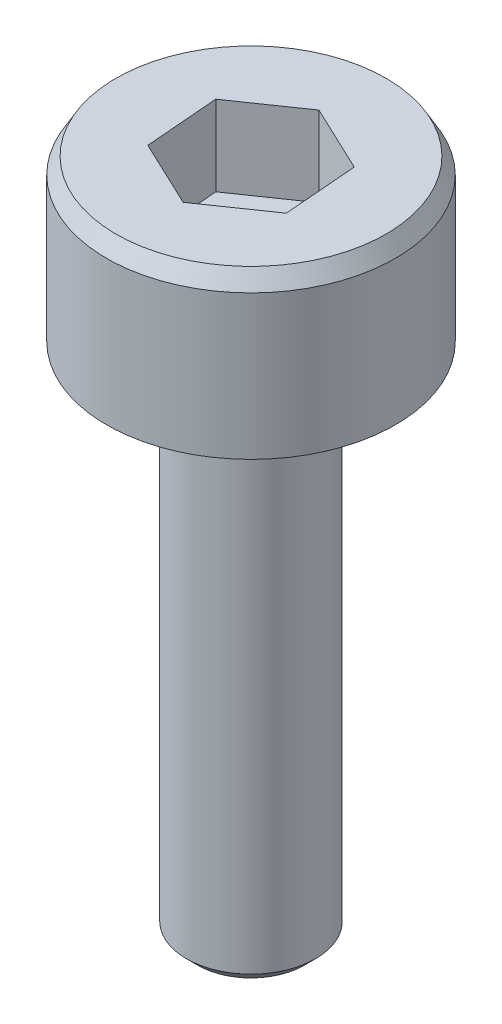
ISO-10303-21;
HEADER;
FILE_DESCRIPTION(('STEP AP214'),'2;1');
FILE_NAME('part.step','',(''),(''),'','','');
FILE_SCHEMA(('AUTOMOTIVE_DESIGN { 1 0 10303 214 1 1 1 1 }'));
ENDSEC;
DATA;
#1=APPLICATION_CONTEXT('core data for automotive mechanical design processes');
#2=APPLICATION_PROTOCOL_DEFINITION('international standard','automotive_design',2000,#1);
#3=PRODUCT_CONTEXT('',#1,'mechanical');
#4=PRODUCT('Part','Part','',(#3));
#5=PRODUCT_RELATED_PRODUCT_CATEGORY('part','',(#4));
#6=PRODUCT_DEFINITION_FORMATION('','',#4);
#7=PRODUCT_DEFINITION_CONTEXT('part definition',#1,'design');
#8=PRODUCT_DEFINITION('design','',#6,#7);
#9=PRODUCT_DEFINITION_SHAPE('','',#8);
#10=(LENGTH_UNIT() NAMED_UNIT(*) SI_UNIT(.MILLI.,.METRE.));
#11=(NAMED_UNIT(*) PLANE_ANGLE_UNIT() SI_UNIT($,.RADIAN.));
#12=(NAMED_UNIT(*) SI_UNIT($,.STERADIAN.) SOLID_ANGLE_UNIT());
#13=UNCERTAINTY_MEASURE_WITH_UNIT(LENGTH_MEASURE(1.E-05),#10,'distance_accuracy_value','');
#14=(GEOMETRIC_REPRESENTATION_CONTEXT(3) GLOBAL_UNCERTAINTY_ASSIGNED_CONTEXT((#13)) GLOBAL_UNIT_ASSIGNED_CONTEXT((#10,
#11,#12)) REPRESENTATION_CONTEXT('',''));
#15=CARTESIAN_POINT('',(0.,0.,0.));
#16=DIRECTION('',(0.,0.,1.));
#17=DIRECTION('',(1.,0.,0.));
#18=AXIS2_PLACEMENT_3D('',#15,#16,#17);
#19=CARTESIAN_POINT('',(-0.279369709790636,8.74059404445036,-3.05433407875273));
#20=DIRECTION('',(0.,-1.,0.));
#21=DIRECTION('',(0.568386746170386,0.,0.82276151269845));
#22=AXIS2_PLACEMENT_3D('',#19,#20,#21);
#23=PLANE('',#22);
#24=DIRECTION('',(-0.904002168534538,0.,-0.427527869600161));
#25=VECTOR('',#24,1.);
#26=CARTESIAN_POINT('',(-0.279369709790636,8.74059404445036,-3.05433407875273));
#27=LINE('',#26,#25);
#28=CARTESIAN_POINT('',(-0.279369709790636,8.74059404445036,-3.05433407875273));
#29=VERTEX_POINT('',#28);
#30=CARTESIAN_POINT('',(-1.32349221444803,8.74059404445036,-3.54812876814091));
#31=VERTEX_POINT('',#30);
#32=EDGE_CURVE('E189',#29,#31,#27,.T.);
#33=ORIENTED_EDGE('',*,*,#32,.T.);
#34=DIRECTION('',(-0.82276151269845,0.,0.568386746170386));
#35=VECTOR('',#34,1.);
#36=CARTESIAN_POINT('',(-1.32349221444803,8.74059404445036,-3.54812876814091));
#37=LINE('',#36,#35);
#38=CARTESIAN_POINT('',(-2.27378176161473,8.74059404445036,-2.89164207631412));
#39=VERTEX_POINT('',#38);
#40=EDGE_CURVE('E11',#31,#39,#37,.T.);
#41=ORIENTED_EDGE('',*,*,#40,.T.);
#42=DIRECTION('',(0.0808566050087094,0.,0.996725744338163));
#43=VECTOR('',#42,1.);
#44=CARTESIAN_POINT('',(-2.27378176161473,8.74059404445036,-2.89164207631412));
#45=LINE('',#44,#43);
#46=CARTESIAN_POINT('',(-2.18039238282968,8.74059404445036,-1.74042384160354));
#47=VERTEX_POINT('',#46);
#48=EDGE_CURVE('E134',#39,#47,#45,.T.);
#49=ORIENTED_EDGE('',*,*,#48,.T.);
#50=DIRECTION('',(0.904002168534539,0.,0.42752786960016));
#51=VECTOR('',#50,1.);
#52=CARTESIAN_POINT('',(-2.18039238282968,8.74059404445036,-1.74042384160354));
#53=LINE('',#52,#51);
#54=CARTESIAN_POINT('',(-1.13626987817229,8.74059404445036,-1.24662915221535));
#55=VERTEX_POINT('',#54);
#56=EDGE_CURVE('E180',#47,#55,#53,.T.);
#57=ORIENTED_EDGE('',*,*,#56,.T.);
#58=DIRECTION('',(0.82276151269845,0.,-0.568386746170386));
#59=VECTOR('',#58,1.);
#60=CARTESIAN_POINT('',(-1.13626987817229,8.74059404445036,-1.24662915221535));
#61=LINE('',#60,#59);
#62=CARTESIAN_POINT('',(-0.185980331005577,8.74059404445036,-1.90311584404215));
#63=VERTEX_POINT('',#62);
#64=EDGE_CURVE('E178',#55,#63,#61,.T.);
#65=ORIENTED_EDGE('',*,*,#64,.T.);
#66=DIRECTION('',(-0.0808566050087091,0.,-0.996725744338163));
#67=VECTOR('',#66,1.);
#68=CARTESIAN_POINT('',(-0.185980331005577,8.74059404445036,-1.90311584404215));
#69=LINE('',#68,#67);
#70=EDGE_CURVE('E143',#63,#29,#69,.T.);
#71=ORIENTED_EDGE('',*,*,#70,.T.);
#72=EDGE_LOOP('',(#33,#41,#49,#57,#65,#71));
#73=FACE_BOUND('',#72,.T.);
#74=ADVANCED_FACE('F16',(#73),#23,.F.);
#75=CARTESIAN_POINT('',(-1.32349221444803,8.74059404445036,-3.54812876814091));
#76=DIRECTION('',(-0.568386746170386,0.,-0.82276151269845));
#77=DIRECTION('',(0.82276151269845,0.,-0.568386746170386));
#78=AXIS2_PLACEMENT_3D('',#75,#76,#77);
#79=PLANE('',#78);
#80=DIRECTION('',(-0.82276151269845,0.,0.568386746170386));
#81=VECTOR('',#80,1.);
#82=CARTESIAN_POINT('',(-1.32349221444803,9.99059404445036,-3.54812876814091));
#83=LINE('',#82,#81);
#84=CARTESIAN_POINT('',(-1.32349221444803,9.99059404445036,-3.54812876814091));
#85=VERTEX_POINT('',#84);
#86=CARTESIAN_POINT('',(-2.27378176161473,9.99059404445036,-2.89164207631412));
#87=VERTEX_POINT('',#86);
#88=EDGE_CURVE('E20',#85,#87,#83,.T.);
#89=ORIENTED_EDGE('',*,*,#88,.T.);
#90=DIRECTION('',(0.,1.,0.));
#91=VECTOR('',#90,1.);
#92=CARTESIAN_POINT('',(-2.27378176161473,8.74059404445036,-2.89164207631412));
#93=LINE('',#92,#91);
#94=EDGE_CURVE('E27',#39,#87,#93,.T.);
#95=ORIENTED_EDGE('',*,*,#94,.F.);
#96=ORIENTED_EDGE('',*,*,#40,.F.);
#97=DIRECTION('',(0.,1.,0.));
#98=VECTOR('',#97,1.);
#99=CARTESIAN_POINT('',(-1.32349221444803,8.74059404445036,-3.54812876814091));
#100=LINE('',#99,#98);
#101=EDGE_CURVE('E164',#31,#85,#100,.T.);
#102=ORIENTED_EDGE('',*,*,#101,.T.);
#103=EDGE_LOOP('',(#89,#95,#96,#102));
#104=FACE_BOUND('',#103,.T.);
#105=ADVANCED_FACE('F162',(#104),#79,.F.);
#106=CARTESIAN_POINT('',(-2.27378176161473,8.74059404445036,-2.89164207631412));
#107=DIRECTION('',(-0.996725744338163,0.,0.0808566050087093));
#108=DIRECTION('',(0.,1.,0.));
#109=AXIS2_PLACEMENT_3D('',#106,#107,#108);
#110=PLANE('',#109);
#111=DIRECTION('',(0.0808566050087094,0.,0.996725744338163));
#112=VECTOR('',#111,1.);
#113=CARTESIAN_POINT('',(-2.27378176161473,9.99059404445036,-2.89164207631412));
#114=LINE('',#113,#112);
#115=CARTESIAN_POINT('',(-2.18039238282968,9.99059404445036,-1.74042384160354));
#116=VERTEX_POINT('',#115);
#117=EDGE_CURVE('E141',#87,#116,#114,.T.);
#118=ORIENTED_EDGE('',*,*,#117,.T.);
#119=DIRECTION('',(0.,1.,0.));
#120=VECTOR('',#119,1.);
#121=CARTESIAN_POINT('',(-2.18039238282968,8.74059404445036,-1.74042384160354));
#122=LINE('',#121,#120);
#123=EDGE_CURVE('E136',#47,#116,#122,.T.);
#124=ORIENTED_EDGE('',*,*,#123,.F.);
#125=ORIENTED_EDGE('',*,*,#48,.F.);
#126=ORIENTED_EDGE('',*,*,#94,.T.);
#127=EDGE_LOOP('',(#118,#124,#125,#126));
#128=FACE_BOUND('',#127,.T.);
#129=ADVANCED_FACE('F156',(#128),#110,.F.);
#130=CARTESIAN_POINT('',(-2.18039238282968,8.74059404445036,-1.74042384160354));
#131=DIRECTION('',(-0.42752786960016,0.,0.904002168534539));
#132=DIRECTION('',(-0.904002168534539,0.,-0.42752786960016));
#133=AXIS2_PLACEMENT_3D('',#130,#131,#132);
#134=PLANE('',#133);
#135=DIRECTION('',(0.904002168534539,0.,0.42752786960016));
#136=VECTOR('',#135,1.);
#137=CARTESIAN_POINT('',(-2.18039238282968,9.99059404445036,-1.74042384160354));
#138=LINE('',#137,#136);
#139=CARTESIAN_POINT('',(-1.13626987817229,9.99059404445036,-1.24662915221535));
#140=VERTEX_POINT('',#139);
#141=EDGE_CURVE('E137',#116,#140,#138,.T.);
#142=ORIENTED_EDGE('',*,*,#141,.T.);
#143=DIRECTION('',(0.,1.,0.));
#144=VECTOR('',#143,1.);
#145=CARTESIAN_POINT('',(-1.13626987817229,8.74059404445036,-1.24662915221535));
#146=LINE('',#145,#144);
#147=EDGE_CURVE('E194',#55,#140,#146,.T.);
#148=ORIENTED_EDGE('',*,*,#147,.F.);
#149=ORIENTED_EDGE('',*,*,#56,.F.);
#150=ORIENTED_EDGE('',*,*,#123,.T.);
#151=EDGE_LOOP('',(#142,#148,#149,#150));
#152=FACE_BOUND('',#151,.T.);
#153=ADVANCED_FACE('F318',(#152),#134,.F.);
#154=CARTESIAN_POINT('',(-1.13626987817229,8.74059404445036,-1.24662915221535));
#155=DIRECTION('',(0.568386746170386,0.,0.82276151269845));
#156=DIRECTION('',(0.,-1.,0.));
#157=AXIS2_PLACEMENT_3D('',#154,#155,#156);
#158=PLANE('',#157);
#159=DIRECTION('',(0.82276151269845,0.,-0.568386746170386));
#160=VECTOR('',#159,1.);
#161=CARTESIAN_POINT('',(-1.13626987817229,9.99059404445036,-1.24662915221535));
#162=LINE('',#161,#160);
#163=CARTESIAN_POINT('',(-0.185980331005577,9.99059404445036,-1.90311584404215));
#164=VERTEX_POINT('',#163);
#165=EDGE_CURVE('E142',#140,#164,#162,.T.);
#166=ORIENTED_EDGE('',*,*,#165,.T.);
#167=DIRECTION('',(0.,1.,0.));
#168=VECTOR('',#167,1.);
#169=CARTESIAN_POINT('',(-0.185980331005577,8.74059404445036,-1.90311584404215));
#170=LINE('',#169,#168);
#171=EDGE_CURVE('E146',#63,#164,#170,.T.);
#172=ORIENTED_EDGE('',*,*,#171,.F.);
#173=ORIENTED_EDGE('',*,*,#64,.F.);
#174=ORIENTED_EDGE('',*,*,#147,.T.);
#175=EDGE_LOOP('',(#166,#172,#173,#174));
#176=FACE_BOUND('',#175,.T.);
#177=ADVANCED_FACE('F314',(#176),#158,.F.);
#178=CARTESIAN_POINT('',(-0.185980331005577,8.74059404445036,-1.90311584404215));
#179=DIRECTION('',(0.996725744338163,0.,-0.0808566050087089));
#180=DIRECTION('',(0.,-1.,0.));
#181=AXIS2_PLACEMENT_3D('',#178,#179,#180);
#182=PLANE('',#181);
#183=DIRECTION('',(-0.0808566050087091,0.,-0.996725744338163));
#184=VECTOR('',#183,1.);
#185=CARTESIAN_POINT('',(-0.185980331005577,9.99059404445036,-1.90311584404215));
#186=LINE('',#185,#184);
#187=CARTESIAN_POINT('',(-0.279369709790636,9.99059404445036,-3.05433407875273));
#188=VERTEX_POINT('',#187);
#189=EDGE_CURVE('E128',#164,#188,#186,.T.);
#190=ORIENTED_EDGE('',*,*,#189,.T.);
#191=DIRECTION('',(0.,1.,0.));
#192=VECTOR('',#191,1.);
#193=CARTESIAN_POINT('',(-0.279369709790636,8.74059404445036,-3.05433407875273));
#194=LINE('',#193,#192);
#195=EDGE_CURVE('E147',#29,#188,#194,.T.);
#196=ORIENTED_EDGE('',*,*,#195,.F.);
#197=ORIENTED_EDGE('',*,*,#70,.F.);
#198=ORIENTED_EDGE('',*,*,#171,.T.);
#199=EDGE_LOOP('',(#190,#196,#197,#198));
#200=FACE_BOUND('',#199,.T.);
#201=ADVANCED_FACE('F308',(#200),#182,.F.);
#202=CARTESIAN_POINT('',(-0.279369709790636,8.74059404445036,-3.05433407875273));
#203=DIRECTION('',(0.427527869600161,0.,-0.904002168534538));
#204=DIRECTION('',(0.,-1.,0.));
#205=AXIS2_PLACEMENT_3D('',#202,#203,#204);
#206=PLANE('',#205);
#207=DIRECTION('',(-0.904002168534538,0.,-0.427527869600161));
#208=VECTOR('',#207,1.);
#209=CARTESIAN_POINT('',(-0.279369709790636,9.99059404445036,-3.05433407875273));
#210=LINE('',#209,#208);
#211=EDGE_CURVE('E119',#188,#85,#210,.T.);
#212=ORIENTED_EDGE('',*,*,#211,.T.);
#213=ORIENTED_EDGE('',*,*,#101,.F.);
#214=ORIENTED_EDGE('',*,*,#32,.F.);
#215=ORIENTED_EDGE('',*,*,#195,.T.);
#216=EDGE_LOOP('',(#212,#213,#214,#215));
#217=FACE_BOUND('',#216,.T.);
#218=ADVANCED_FACE('F304',(#217),#206,.F.);
#219=CARTESIAN_POINT('',(-1.230250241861,7.49059404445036,-2.39712390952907));
#220=DIRECTION('',(0.,1.,0.));
#221=DIRECTION('',(0.82276151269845,0.,-0.568386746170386));
#222=AXIS2_PLACEMENT_3D('',#219,#220,#221);
#223=PLANE('',#222);
#224=CARTESIAN_POINT('',(-1.230250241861,7.49059404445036,-2.39712390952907));
#225=DIRECTION('',(0.,1.,0.));
#226=DIRECTION('',(0.82276151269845,0.,-0.568386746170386));
#227=AXIS2_PLACEMENT_3D('',#224,#225,#226);
#228=CIRCLE('',#227,1.0055);
#229=CARTESIAN_POINT('',(-0.402963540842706,7.49059404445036,-2.96863678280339));
#230=VERTEX_POINT('',#229);
#231=EDGE_CURVE('E114',#230,#230,#228,.T.);
#232=ORIENTED_EDGE('',*,*,#231,.T.);
#233=EDGE_LOOP('',(#232));
#234=FACE_BOUND('',#233,.T.);
#235=CARTESIAN_POINT('',(-1.230250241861,7.49059404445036,-2.39712390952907));
#236=DIRECTION('',(0.,1.,0.));
#237=DIRECTION('',(0.82276151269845,0.,-0.568386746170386));
#238=AXIS2_PLACEMENT_3D('',#235,#236,#237);
#239=CIRCLE('',#238,2.25);
#240=CARTESIAN_POINT('',(-3.08146364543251,7.49059404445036,-1.1182537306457));
#241=VERTEX_POINT('',#240);
#242=EDGE_CURVE('E120',#241,#241,#239,.T.);
#243=ORIENTED_EDGE('',*,*,#242,.F.);
#244=EDGE_LOOP('',(#243));
#245=FACE_BOUND('',#244,.T.);
#246=ADVANCED_FACE('F115',(#234,#245),#223,.F.);
#247=CARTESIAN_POINT('',(-1.230250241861,9.99059404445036,-2.39712390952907));
#248=DIRECTION('',(0.,1.,0.));
#249=DIRECTION('',(0.82276151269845,0.,-0.568386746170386));
#250=AXIS2_PLACEMENT_3D('',#247,#248,#249);
#251=PLANE('',#250);
#252=ORIENTED_EDGE('',*,*,#211,.F.);
#253=ORIENTED_EDGE('',*,*,#189,.F.);
#254=ORIENTED_EDGE('',*,*,#165,.F.);
#255=ORIENTED_EDGE('',*,*,#141,.F.);
#256=ORIENTED_EDGE('',*,*,#117,.F.);
#257=ORIENTED_EDGE('',*,*,#88,.F.);
#258=EDGE_LOOP('',(#252,#253,#254,#255,#256,#257));
#259=FACE_BOUND('',#258,.T.);
#260=CARTESIAN_POINT('',(-1.230250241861,9.99059404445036,-2.39712390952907));
#261=DIRECTION('',(0.,1.,0.));
#262=DIRECTION('',(0.82276151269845,0.,-0.568386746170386));
#263=AXIS2_PLACEMENT_3D('',#260,#261,#262);
#264=CIRCLE('',#263,2.10335303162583);
#265=CARTESIAN_POINT('',(-2.96080816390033,9.99059404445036,-1.20160592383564));
#266=VERTEX_POINT('',#265);
#267=EDGE_CURVE('E184',#266,#266,#264,.T.);
#268=ORIENTED_EDGE('',*,*,#267,.T.);
#269=EDGE_LOOP('',(#268));
#270=FACE_BOUND('',#269,.T.);
#271=ADVANCED_FACE('F167',(#259,#270),#251,.T.);
#272=CARTESIAN_POINT('',(-1.230250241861,-0.509405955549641,-2.39712390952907));
#273=DIRECTION('',(0.,1.,0.));
#274=DIRECTION('',(0.82276151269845,0.,-0.568386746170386));
#275=AXIS2_PLACEMENT_3D('',#272,#273,#274);
#276=PLANE('',#275);
#277=CARTESIAN_POINT('',(-1.230250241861,-0.509405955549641,-2.39712390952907));
#278=DIRECTION('',(0.,-1.,0.));
#279=DIRECTION('',(0.82276151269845,0.,-0.568386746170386));
#280=AXIS2_PLACEMENT_3D('',#277,#278,#279);
#281=CIRCLE('',#280,0.8305);
#282=CARTESIAN_POINT('',(-0.546946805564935,-0.509405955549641,-2.86916910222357));
#283=VERTEX_POINT('',#282);
#284=EDGE_CURVE('E81',#283,#283,#281,.T.);
#285=ORIENTED_EDGE('',*,*,#284,.T.);
#286=EDGE_LOOP('',(#285));
#287=FACE_BOUND('',#286,.T.);
#288=ADVANCED_FACE('F18',(#287),#276,.F.);
#289=CARTESIAN_POINT('',(-1.230250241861,-0.509405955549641,-2.39712390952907));
#290=DIRECTION('',(0.,1.,0.));
#291=DIRECTION('',(0.82276151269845,0.,-0.568386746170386));
#292=AXIS2_PLACEMENT_3D('',#289,#290,#291);
#293=CYLINDRICAL_SURFACE('',#292,1.0055);
#294=ORIENTED_EDGE('',*,*,#231,.F.);
#295=EDGE_LOOP('',(#294));
#296=FACE_BOUND('',#295,.T.);
#297=CARTESIAN_POINT('',(-1.230250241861,-0.334405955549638,-2.39712390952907));
#298=DIRECTION('',(0.,1.,0.));
#299=DIRECTION('',(0.82276151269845,0.,-0.568386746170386));
#300=AXIS2_PLACEMENT_3D('',#297,#298,#299);
#301=CIRCLE('',#300,1.0055);
#302=CARTESIAN_POINT('',(-0.402963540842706,-0.334405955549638,-2.96863678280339));
#303=VERTEX_POINT('',#302);
#304=EDGE_CURVE('E91',#303,#303,#301,.T.);
#305=ORIENTED_EDGE('',*,*,#304,.T.);
#306=EDGE_LOOP('',(#305));
#307=FACE_BOUND('',#306,.T.);
#308=ADVANCED_FACE('F288',(#296,#307),#293,.T.);
#309=CARTESIAN_POINT('',(-1.230250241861,9.99059404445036,-2.39712390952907));
#310=DIRECTION('',(0.,-1.,0.));
#311=DIRECTION('',(-0.82276151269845,0.,0.568386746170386));
#312=AXIS2_PLACEMENT_3D('',#309,#310,#311);
#313=CYLINDRICAL_SURFACE('',#312,2.25);
#314=ORIENTED_EDGE('',*,*,#242,.T.);
#315=EDGE_LOOP('',(#314));
#316=FACE_BOUND('',#315,.T.);
#317=CARTESIAN_POINT('',(-1.230250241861,9.73659404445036,-2.39712390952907));
#318=DIRECTION('',(0.,-1.,0.));
#319=DIRECTION('',(0.82276151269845,0.,-0.568386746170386));
#320=AXIS2_PLACEMENT_3D('',#317,#318,#319);
#321=CIRCLE('',#320,2.25);
#322=CARTESIAN_POINT('',(-3.08146364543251,9.73659404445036,-1.1182537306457));
#323=VERTEX_POINT('',#322);
#324=EDGE_CURVE('E130',#323,#323,#321,.T.);
#325=ORIENTED_EDGE('',*,*,#324,.T.);
#326=EDGE_LOOP('',(#325));
#327=FACE_BOUND('',#326,.T.);
#328=ADVANCED_FACE('F292',(#316,#327),#313,.T.);
#329=CARTESIAN_POINT('',(-1.230250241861,9.99059404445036,-2.39712390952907));
#330=DIRECTION('',(0.,-1.,0.));
#331=DIRECTION('',(-0.82276151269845,0.,0.568386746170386));
#332=AXIS2_PLACEMENT_3D('',#329,#330,#331);
#333=CONICAL_SURFACE('',#332,2.10335303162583,0.5235987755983);
#334=ORIENTED_EDGE('',*,*,#324,.F.);
#335=EDGE_LOOP('',(#334));
#336=FACE_BOUND('',#335,.T.);
#337=ORIENTED_EDGE('',*,*,#267,.F.);
#338=EDGE_LOOP('',(#337));
#339=FACE_BOUND('',#338,.T.);
#340=ADVANCED_FACE('F347',(#336,#339),#333,.T.);
#341=CARTESIAN_POINT('',(-1.230250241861,-0.334405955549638,-2.39712390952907));
#342=DIRECTION('',(0.,1.,0.));
#343=DIRECTION('',(0.82276151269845,0.,-0.568386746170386));
#344=AXIS2_PLACEMENT_3D('',#341,#342,#343);
#345=CONICAL_SURFACE('',#344,1.0055,0.785398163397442);
#346=ORIENTED_EDGE('',*,*,#304,.F.);
#347=EDGE_LOOP('',(#346));
#348=FACE_BOUND('',#347,.T.);
#349=ORIENTED_EDGE('',*,*,#284,.F.);
#350=EDGE_LOOP('',(#349));
#351=FACE_BOUND('',#350,.T.);
#352=ADVANCED_FACE('F370',(#348,#351),#345,.T.);
#353=CLOSED_SHELL('',(#74,#105,#129,#153,#177,#201,#218,#246,#271,#288,#308,#328,#340,#352));
#354=MANIFOLD_SOLID_BREP('B1',#353);
#355=ADVANCED_BREP_SHAPE_REPRESENTATION('',(#18,#354),#14);
#356=SHAPE_DEFINITION_REPRESENTATION(#9,#355);
ENDSEC;
END-ISO-10303-21;
